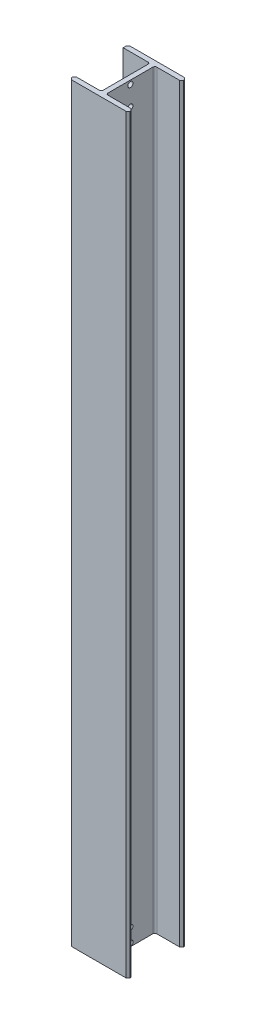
from build123d import *

# Parameters (mm, degrees)
EXTRUDE1_DEPTH     = 977.9
FILLET1_R          = 2.54
CHAMFER1_SIZE      = 2.54
SKETCH3_R          = 3.3782
CUT_EXTRUDE2_DEPTH = 982.732384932


with BuildPart() as part:
    # Sketch1 → Extrude1 (new body)
    with BuildSketch(Plane(origin=(0, 0, 0), x_dir=(1, 0, 0), z_dir=(0, 1, 0))):
        Polygon((0, 0), (-41.275, 0), (-41.275, -6.35), (-6.35, -6.35), (-6.35, -69.85), (-41.275, -69.85), (-41.275, -76.2), (34.925, -76.2), (34.925, -69.85), (0, -69.85), (0, -6.35), (34.925, -6.35), (34.925, 0), align=None)
    extrude(amount=EXTRUDE1_DEPTH)

    # Fillet1
    fillet1_edges = [part.edges().sort_by_distance(p)[0] for p in [
        (0, 488.95, 6.35),
        (0, 488.95, 69.85),
        (-6.35, 488.95, 69.85),
        (-6.35, 488.95, 6.35),
    ]]
    fillet(fillet1_edges, radius=FILLET1_R)

    # Chamfer1
    chamfer1_edges = [part.edges().sort_by_distance(p)[0] for p in [
        (34.925, 488.95, 0),
        (34.925, 488.95, 6.35),
        (34.925, 488.95, 69.85),
        (34.925, 488.95, 76.2),
        (-41.275, 488.95, 76.2),
        (-41.275, 488.95, 69.85),
        (-41.275, 488.95, 0),
    ]]
    chamfer(chamfer1_edges, length=CHAMFER1_SIZE)

    # Sketch3 → Cut-Extrude2 (cut, through all)
    with BuildSketch(Plane(origin=(0, 0, 0), x_dir=(0, 0, -1), z_dir=(1, 0, 0))):
        with Locations((-38.1, 972.82)):
            Circle(SKETCH3_R)
        with Locations((-38.1, 947.42)):
            Circle(SKETCH3_R)
        with Locations((-38.1, 3.81)):
            Circle(SKETCH3_R)
        with Locations((-38.1, 21.59)):
            Circle(SKETCH3_R)
    extrude(amount=-CUT_EXTRUDE2_DEPTH, mode=Mode.SUBTRACT)


solid = part.part
